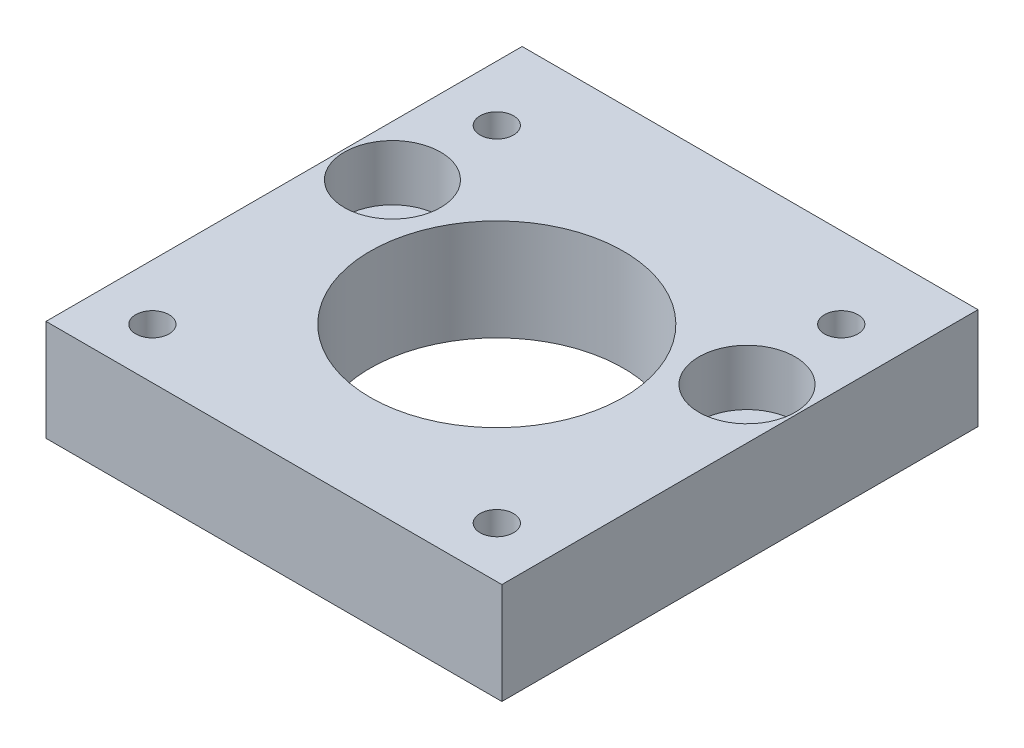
ISO-10303-21;
HEADER;
FILE_DESCRIPTION(('STEP AP214'),'2;1');
FILE_NAME('part.step','',(''),(''),'','','');
FILE_SCHEMA(('AUTOMOTIVE_DESIGN { 1 0 10303 214 1 1 1 1 }'));
ENDSEC;
DATA;
#1=APPLICATION_CONTEXT('core data for automotive mechanical design processes');
#2=APPLICATION_PROTOCOL_DEFINITION('international standard','automotive_design',2000,#1);
#3=PRODUCT_CONTEXT('',#1,'mechanical');
#4=PRODUCT('Part','Part','',(#3));
#5=PRODUCT_RELATED_PRODUCT_CATEGORY('part','',(#4));
#6=PRODUCT_DEFINITION_FORMATION('','',#4);
#7=PRODUCT_DEFINITION_CONTEXT('part definition',#1,'design');
#8=PRODUCT_DEFINITION('design','',#6,#7);
#9=PRODUCT_DEFINITION_SHAPE('','',#8);
#10=(LENGTH_UNIT() NAMED_UNIT(*) SI_UNIT(.MILLI.,.METRE.));
#11=(NAMED_UNIT(*) PLANE_ANGLE_UNIT() SI_UNIT($,.RADIAN.));
#12=(NAMED_UNIT(*) SI_UNIT($,.STERADIAN.) SOLID_ANGLE_UNIT());
#13=UNCERTAINTY_MEASURE_WITH_UNIT(LENGTH_MEASURE(1.E-05),#10,'distance_accuracy_value','');
#14=(GEOMETRIC_REPRESENTATION_CONTEXT(3) GLOBAL_UNCERTAINTY_ASSIGNED_CONTEXT((#13)) GLOBAL_UNIT_ASSIGNED_CONTEXT((#10,
#11,#12)) REPRESENTATION_CONTEXT('',''));
#15=CARTESIAN_POINT('',(0.,0.,0.));
#16=DIRECTION('',(0.,0.,1.));
#17=DIRECTION('',(1.,0.,0.));
#18=AXIS2_PLACEMENT_3D('',#15,#16,#17);
#19=CARTESIAN_POINT('',(5.,-36.9999999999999,17.7999999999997));
#20=DIRECTION('',(0.,1.,0.));
#21=DIRECTION('',(0.,0.,1.));
#22=AXIS2_PLACEMENT_3D('',#19,#20,#21);
#23=CYLINDRICAL_SURFACE('',#22,2.75);
#24=CARTESIAN_POINT('',(5.,1.11022302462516E-13,17.7999999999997));
#25=DIRECTION('',(0.,1.,0.));
#26=DIRECTION('',(0.,0.,1.));
#27=AXIS2_PLACEMENT_3D('',#24,#25,#26);
#28=CIRCLE('',#27,2.75);
#29=CARTESIAN_POINT('',(5.,1.11022302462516E-13,20.5499999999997));
#30=VERTEX_POINT('',#29);
#31=EDGE_CURVE('E109',#30,#30,#28,.T.);
#32=ORIENTED_EDGE('',*,*,#31,.F.);
#33=EDGE_LOOP('',(#32));
#34=FACE_BOUND('',#33,.T.);
#35=CARTESIAN_POINT('',(5.,4.50000000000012,17.7999999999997));
#36=DIRECTION('',(0.,1.,0.));
#37=DIRECTION('',(0.,0.,1.));
#38=AXIS2_PLACEMENT_3D('',#35,#36,#37);
#39=CIRCLE('',#38,2.75);
#40=CARTESIAN_POINT('',(5.,4.50000000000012,20.5499999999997));
#41=VERTEX_POINT('',#40);
#42=EDGE_CURVE('E36',#41,#41,#39,.F.);
#43=ORIENTED_EDGE('',*,*,#42,.F.);
#44=EDGE_LOOP('',(#43));
#45=FACE_BOUND('',#44,.T.);
#46=ADVANCED_FACE('F32',(#34,#45),#23,.F.);
#47=CARTESIAN_POINT('',(40.,-36.9999999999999,17.7999999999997));
#48=DIRECTION('',(0.,1.,0.));
#49=DIRECTION('',(0.,0.,1.));
#50=AXIS2_PLACEMENT_3D('',#47,#48,#49);
#51=CYLINDRICAL_SURFACE('',#50,2.75);
#52=CARTESIAN_POINT('',(40.,1.11022302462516E-13,17.7999999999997));
#53=DIRECTION('',(0.,1.,0.));
#54=DIRECTION('',(0.,0.,1.));
#55=AXIS2_PLACEMENT_3D('',#52,#53,#54);
#56=CIRCLE('',#55,2.75);
#57=CARTESIAN_POINT('',(40.,1.11022302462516E-13,20.5499999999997));
#58=VERTEX_POINT('',#57);
#59=EDGE_CURVE('E114',#58,#58,#56,.T.);
#60=ORIENTED_EDGE('',*,*,#59,.F.);
#61=EDGE_LOOP('',(#60));
#62=FACE_BOUND('',#61,.T.);
#63=CARTESIAN_POINT('',(40.,4.50000000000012,17.7999999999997));
#64=DIRECTION('',(0.,1.,0.));
#65=DIRECTION('',(0.,0.,1.));
#66=AXIS2_PLACEMENT_3D('',#63,#64,#65);
#67=CIRCLE('',#66,2.75);
#68=CARTESIAN_POINT('',(40.,4.50000000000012,20.5499999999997));
#69=VERTEX_POINT('',#68);
#70=EDGE_CURVE('E107',#69,#69,#67,.F.);
#71=ORIENTED_EDGE('',*,*,#70,.F.);
#72=EDGE_LOOP('',(#71));
#73=FACE_BOUND('',#72,.T.);
#74=ADVANCED_FACE('F177',(#62,#73),#51,.F.);
#75=CARTESIAN_POINT('',(0.,1.13686837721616E-13,47.));
#76=DIRECTION('',(1.,0.,0.));
#77=DIRECTION('',(0.,0.,-1.));
#78=AXIS2_PLACEMENT_3D('',#75,#76,#77);
#79=PLANE('',#78);
#80=DIRECTION('',(0.,-1.,0.));
#81=VECTOR('',#80,1.);
#82=CARTESIAN_POINT('',(0.,1.13686837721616E-13,0.));
#83=LINE('',#82,#81);
#84=CARTESIAN_POINT('',(0.,10.0000000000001,0.));
#85=VERTEX_POINT('',#84);
#86=CARTESIAN_POINT('',(0.,1.13686837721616E-13,0.));
#87=VERTEX_POINT('',#86);
#88=EDGE_CURVE('E99',#85,#87,#83,.T.);
#89=ORIENTED_EDGE('',*,*,#88,.T.);
#90=DIRECTION('',(0.,0.,-1.));
#91=VECTOR('',#90,1.);
#92=CARTESIAN_POINT('',(0.,1.13686837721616E-13,47.));
#93=LINE('',#92,#91);
#94=CARTESIAN_POINT('',(0.,1.13686837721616E-13,47.));
#95=VERTEX_POINT('',#94);
#96=EDGE_CURVE('E11',#95,#87,#93,.T.);
#97=ORIENTED_EDGE('',*,*,#96,.F.);
#98=DIRECTION('',(0.,-1.,0.));
#99=VECTOR('',#98,1.);
#100=CARTESIAN_POINT('',(0.,1.13686837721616E-13,47.));
#101=LINE('',#100,#99);
#102=CARTESIAN_POINT('',(0.,10.0000000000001,47.));
#103=VERTEX_POINT('',#102);
#104=EDGE_CURVE('E86',#103,#95,#101,.T.);
#105=ORIENTED_EDGE('',*,*,#104,.F.);
#106=DIRECTION('',(0.,0.,-1.));
#107=VECTOR('',#106,1.);
#108=CARTESIAN_POINT('',(0.,10.0000000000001,47.));
#109=LINE('',#108,#107);
#110=EDGE_CURVE('E95',#103,#85,#109,.T.);
#111=ORIENTED_EDGE('',*,*,#110,.T.);
#112=EDGE_LOOP('',(#89,#97,#105,#111));
#113=FACE_BOUND('',#112,.T.);
#114=ADVANCED_FACE('F34',(#113),#79,.F.);
#115=CARTESIAN_POINT('',(0.,1.13686837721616E-13,47.));
#116=DIRECTION('',(0.,1.,0.));
#117=DIRECTION('',(0.,0.,1.));
#118=AXIS2_PLACEMENT_3D('',#115,#116,#117);
#119=PLANE('',#118);
#120=ORIENTED_EDGE('',*,*,#31,.T.);
#121=EDGE_LOOP('',(#120));
#122=FACE_BOUND('',#121,.T.);
#123=ORIENTED_EDGE('',*,*,#59,.T.);
#124=EDGE_LOOP('',(#123));
#125=FACE_BOUND('',#124,.T.);
#126=CARTESIAN_POINT('',(5.5,1.11022302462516E-13,42.));
#127=DIRECTION('',(0.,1.,0.));
#128=DIRECTION('',(0.,0.,1.));
#129=AXIS2_PLACEMENT_3D('',#126,#127,#128);
#130=CIRCLE('',#129,1.65);
#131=CARTESIAN_POINT('',(5.5,1.11022302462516E-13,43.65));
#132=VERTEX_POINT('',#131);
#133=EDGE_CURVE('E132',#132,#132,#130,.T.);
#134=ORIENTED_EDGE('',*,*,#133,.T.);
#135=EDGE_LOOP('',(#134));
#136=FACE_BOUND('',#135,.T.);
#137=CARTESIAN_POINT('',(39.5,1.11022302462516E-13,42.));
#138=DIRECTION('',(0.,1.,0.));
#139=DIRECTION('',(0.,0.,1.));
#140=AXIS2_PLACEMENT_3D('',#137,#138,#139);
#141=CIRCLE('',#140,1.65);
#142=CARTESIAN_POINT('',(39.5,1.11022302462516E-13,43.65));
#143=VERTEX_POINT('',#142);
#144=EDGE_CURVE('E138',#143,#143,#141,.T.);
#145=ORIENTED_EDGE('',*,*,#144,.T.);
#146=EDGE_LOOP('',(#145));
#147=FACE_BOUND('',#146,.T.);
#148=CARTESIAN_POINT('',(39.5,1.11022302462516E-13,8.));
#149=DIRECTION('',(0.,1.,0.));
#150=DIRECTION('',(0.,0.,1.));
#151=AXIS2_PLACEMENT_3D('',#148,#149,#150);
#152=CIRCLE('',#151,1.65);
#153=CARTESIAN_POINT('',(39.5,1.11022302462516E-13,9.65));
#154=VERTEX_POINT('',#153);
#155=EDGE_CURVE('E144',#154,#154,#152,.T.);
#156=ORIENTED_EDGE('',*,*,#155,.T.);
#157=EDGE_LOOP('',(#156));
#158=FACE_BOUND('',#157,.T.);
#159=CARTESIAN_POINT('',(5.5,1.11022302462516E-13,8.));
#160=DIRECTION('',(0.,1.,0.));
#161=DIRECTION('',(0.,0.,1.));
#162=AXIS2_PLACEMENT_3D('',#159,#160,#161);
#163=CIRCLE('',#162,1.65);
#164=CARTESIAN_POINT('',(5.5,1.11022302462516E-13,9.65));
#165=VERTEX_POINT('',#164);
#166=EDGE_CURVE('E150',#165,#165,#163,.T.);
#167=ORIENTED_EDGE('',*,*,#166,.T.);
#168=EDGE_LOOP('',(#167));
#169=FACE_BOUND('',#168,.T.);
#170=CARTESIAN_POINT('',(22.5000000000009,1.11022302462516E-13,25.));
#171=DIRECTION('',(0.,1.,0.));
#172=DIRECTION('',(0.,0.,1.));
#173=AXIS2_PLACEMENT_3D('',#170,#171,#172);
#174=CIRCLE('',#173,12.5);
#175=CARTESIAN_POINT('',(22.5000000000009,1.11022302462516E-13,37.5));
#176=VERTEX_POINT('',#175);
#177=EDGE_CURVE('E102',#176,#176,#174,.T.);
#178=ORIENTED_EDGE('',*,*,#177,.T.);
#179=EDGE_LOOP('',(#178));
#180=FACE_BOUND('',#179,.T.);
#181=DIRECTION('',(1.,0.,0.));
#182=VECTOR('',#181,1.);
#183=CARTESIAN_POINT('',(0.,1.13686837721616E-13,0.));
#184=LINE('',#183,#182);
#185=CARTESIAN_POINT('',(45.,1.13686837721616E-13,0.));
#186=VERTEX_POINT('',#185);
#187=EDGE_CURVE('E90',#87,#186,#184,.T.);
#188=ORIENTED_EDGE('',*,*,#187,.T.);
#189=DIRECTION('',(0.,0.,-1.));
#190=VECTOR('',#189,1.);
#191=CARTESIAN_POINT('',(45.,1.13686837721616E-13,47.));
#192=LINE('',#191,#190);
#193=CARTESIAN_POINT('',(45.,1.13686837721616E-13,47.));
#194=VERTEX_POINT('',#193);
#195=EDGE_CURVE('E42',#194,#186,#192,.T.);
#196=ORIENTED_EDGE('',*,*,#195,.F.);
#197=DIRECTION('',(1.,0.,0.));
#198=VECTOR('',#197,1.);
#199=CARTESIAN_POINT('',(0.,1.13686837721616E-13,47.));
#200=LINE('',#199,#198);
#201=EDGE_CURVE('E81',#95,#194,#200,.T.);
#202=ORIENTED_EDGE('',*,*,#201,.F.);
#203=ORIENTED_EDGE('',*,*,#96,.T.);
#204=EDGE_LOOP('',(#188,#196,#202,#203));
#205=FACE_BOUND('',#204,.T.);
#206=ADVANCED_FACE('F89',(#122,#125,#136,#147,#158,#169,#180,#205),#119,.F.);
#207=CARTESIAN_POINT('',(45.,1.13686837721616E-13,47.));
#208=DIRECTION('',(-1.,0.,0.));
#209=DIRECTION('',(0.,0.,1.));
#210=AXIS2_PLACEMENT_3D('',#207,#208,#209);
#211=PLANE('',#210);
#212=DIRECTION('',(0.,1.,0.));
#213=VECTOR('',#212,1.);
#214=CARTESIAN_POINT('',(45.,1.13686837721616E-13,0.));
#215=LINE('',#214,#213);
#216=CARTESIAN_POINT('',(45.,10.0000000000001,0.));
#217=VERTEX_POINT('',#216);
#218=EDGE_CURVE('E68',#186,#217,#215,.T.);
#219=ORIENTED_EDGE('',*,*,#218,.T.);
#220=DIRECTION('',(0.,0.,-1.));
#221=VECTOR('',#220,1.);
#222=CARTESIAN_POINT('',(45.,10.0000000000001,47.));
#223=LINE('',#222,#221);
#224=CARTESIAN_POINT('',(45.,10.0000000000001,47.));
#225=VERTEX_POINT('',#224);
#226=EDGE_CURVE('E91',#225,#217,#223,.T.);
#227=ORIENTED_EDGE('',*,*,#226,.F.);
#228=DIRECTION('',(0.,1.,0.));
#229=VECTOR('',#228,1.);
#230=CARTESIAN_POINT('',(45.,1.13686837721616E-13,47.));
#231=LINE('',#230,#229);
#232=EDGE_CURVE('E84',#194,#225,#231,.T.);
#233=ORIENTED_EDGE('',*,*,#232,.F.);
#234=ORIENTED_EDGE('',*,*,#195,.T.);
#235=EDGE_LOOP('',(#219,#227,#233,#234));
#236=FACE_BOUND('',#235,.T.);
#237=ADVANCED_FACE('F93',(#236),#211,.F.);
#238=CARTESIAN_POINT('',(0.,10.0000000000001,47.));
#239=DIRECTION('',(0.,-1.,0.));
#240=DIRECTION('',(0.,0.,-1.));
#241=AXIS2_PLACEMENT_3D('',#238,#239,#240);
#242=PLANE('',#241);
#243=CARTESIAN_POINT('',(5.,10.0000000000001,17.7999999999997));
#244=DIRECTION('',(0.,1.,0.));
#245=DIRECTION('',(0.,0.,1.));
#246=AXIS2_PLACEMENT_3D('',#243,#244,#245);
#247=CIRCLE('',#246,4.75);
#248=CARTESIAN_POINT('',(5.,10.0000000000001,22.5499999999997));
#249=VERTEX_POINT('',#248);
#250=EDGE_CURVE('E124',#249,#249,#247,.T.);
#251=ORIENTED_EDGE('',*,*,#250,.F.);
#252=EDGE_LOOP('',(#251));
#253=FACE_BOUND('',#252,.T.);
#254=CARTESIAN_POINT('',(40.,10.0000000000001,17.7999999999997));
#255=DIRECTION('',(0.,1.,0.));
#256=DIRECTION('',(0.,0.,1.));
#257=AXIS2_PLACEMENT_3D('',#254,#255,#256);
#258=CIRCLE('',#257,4.75);
#259=CARTESIAN_POINT('',(40.,10.0000000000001,22.5499999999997));
#260=VERTEX_POINT('',#259);
#261=EDGE_CURVE('E117',#260,#260,#258,.T.);
#262=ORIENTED_EDGE('',*,*,#261,.F.);
#263=EDGE_LOOP('',(#262));
#264=FACE_BOUND('',#263,.T.);
#265=CARTESIAN_POINT('',(5.5,10.0000000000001,42.));
#266=DIRECTION('',(0.,1.,0.));
#267=DIRECTION('',(0.,0.,1.));
#268=AXIS2_PLACEMENT_3D('',#265,#266,#267);
#269=CIRCLE('',#268,1.65);
#270=CARTESIAN_POINT('',(5.5,10.0000000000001,43.65));
#271=VERTEX_POINT('',#270);
#272=EDGE_CURVE('E129',#271,#271,#269,.T.);
#273=ORIENTED_EDGE('',*,*,#272,.F.);
#274=EDGE_LOOP('',(#273));
#275=FACE_BOUND('',#274,.T.);
#276=CARTESIAN_POINT('',(39.5,10.0000000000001,42.));
#277=DIRECTION('',(0.,1.,0.));
#278=DIRECTION('',(0.,0.,1.));
#279=AXIS2_PLACEMENT_3D('',#276,#277,#278);
#280=CIRCLE('',#279,1.65);
#281=CARTESIAN_POINT('',(39.5,10.0000000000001,43.65));
#282=VERTEX_POINT('',#281);
#283=EDGE_CURVE('E135',#282,#282,#280,.T.);
#284=ORIENTED_EDGE('',*,*,#283,.F.);
#285=EDGE_LOOP('',(#284));
#286=FACE_BOUND('',#285,.T.);
#287=CARTESIAN_POINT('',(39.5,10.0000000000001,8.));
#288=DIRECTION('',(0.,1.,0.));
#289=DIRECTION('',(0.,0.,1.));
#290=AXIS2_PLACEMENT_3D('',#287,#288,#289);
#291=CIRCLE('',#290,1.65);
#292=CARTESIAN_POINT('',(39.5,10.0000000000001,9.65));
#293=VERTEX_POINT('',#292);
#294=EDGE_CURVE('E141',#293,#293,#291,.T.);
#295=ORIENTED_EDGE('',*,*,#294,.F.);
#296=EDGE_LOOP('',(#295));
#297=FACE_BOUND('',#296,.T.);
#298=CARTESIAN_POINT('',(5.5,10.0000000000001,8.));
#299=DIRECTION('',(0.,1.,0.));
#300=DIRECTION('',(0.,0.,1.));
#301=AXIS2_PLACEMENT_3D('',#298,#299,#300);
#302=CIRCLE('',#301,1.65);
#303=CARTESIAN_POINT('',(5.5,10.0000000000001,9.65));
#304=VERTEX_POINT('',#303);
#305=EDGE_CURVE('E147',#304,#304,#302,.T.);
#306=ORIENTED_EDGE('',*,*,#305,.F.);
#307=EDGE_LOOP('',(#306));
#308=FACE_BOUND('',#307,.T.);
#309=CARTESIAN_POINT('',(22.5000000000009,10.0000000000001,25.));
#310=DIRECTION('',(0.,1.,0.));
#311=DIRECTION('',(0.,0.,1.));
#312=AXIS2_PLACEMENT_3D('',#309,#310,#311);
#313=CIRCLE('',#312,12.5);
#314=CARTESIAN_POINT('',(22.5000000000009,10.0000000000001,37.5));
#315=VERTEX_POINT('',#314);
#316=EDGE_CURVE('E153',#315,#315,#313,.T.);
#317=ORIENTED_EDGE('',*,*,#316,.F.);
#318=EDGE_LOOP('',(#317));
#319=FACE_BOUND('',#318,.T.);
#320=DIRECTION('',(-1.,0.,0.));
#321=VECTOR('',#320,1.);
#322=CARTESIAN_POINT('',(0.,10.0000000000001,0.));
#323=LINE('',#322,#321);
#324=EDGE_CURVE('E74',#217,#85,#323,.T.);
#325=ORIENTED_EDGE('',*,*,#324,.T.);
#326=ORIENTED_EDGE('',*,*,#110,.F.);
#327=DIRECTION('',(-1.,0.,0.));
#328=VECTOR('',#327,1.);
#329=CARTESIAN_POINT('',(0.,10.0000000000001,47.));
#330=LINE('',#329,#328);
#331=EDGE_CURVE('E51',#225,#103,#330,.T.);
#332=ORIENTED_EDGE('',*,*,#331,.F.);
#333=ORIENTED_EDGE('',*,*,#226,.T.);
#334=EDGE_LOOP('',(#325,#326,#332,#333));
#335=FACE_BOUND('',#334,.T.);
#336=ADVANCED_FACE('F217',(#253,#264,#275,#286,#297,#308,#319,#335),#242,.F.);
#337=CARTESIAN_POINT('',(0.,10.0000000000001,47.));
#338=DIRECTION('',(0.,0.,-1.));
#339=DIRECTION('',(-1.,0.,0.));
#340=AXIS2_PLACEMENT_3D('',#337,#338,#339);
#341=PLANE('',#340);
#342=ORIENTED_EDGE('',*,*,#104,.T.);
#343=ORIENTED_EDGE('',*,*,#201,.T.);
#344=ORIENTED_EDGE('',*,*,#232,.T.);
#345=ORIENTED_EDGE('',*,*,#331,.T.);
#346=EDGE_LOOP('',(#342,#343,#344,#345));
#347=FACE_BOUND('',#346,.T.);
#348=ADVANCED_FACE('F82',(#347),#341,.F.);
#349=CARTESIAN_POINT('',(0.,10.0000000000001,0.));
#350=DIRECTION('',(0.,0.,-1.));
#351=DIRECTION('',(-1.,0.,0.));
#352=AXIS2_PLACEMENT_3D('',#349,#350,#351);
#353=PLANE('',#352);
#354=ORIENTED_EDGE('',*,*,#88,.F.);
#355=ORIENTED_EDGE('',*,*,#324,.F.);
#356=ORIENTED_EDGE('',*,*,#218,.F.);
#357=ORIENTED_EDGE('',*,*,#187,.F.);
#358=EDGE_LOOP('',(#354,#355,#356,#357));
#359=FACE_BOUND('',#358,.T.);
#360=ADVANCED_FACE('F163',(#359),#353,.T.);
#361=CARTESIAN_POINT('',(22.5000000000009,-36.9999999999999,25.));
#362=DIRECTION('',(0.,1.,0.));
#363=DIRECTION('',(0.,0.,1.));
#364=AXIS2_PLACEMENT_3D('',#361,#362,#363);
#365=CYLINDRICAL_SURFACE('',#364,12.5);
#366=ORIENTED_EDGE('',*,*,#316,.T.);
#367=EDGE_LOOP('',(#366));
#368=FACE_BOUND('',#367,.T.);
#369=ORIENTED_EDGE('',*,*,#177,.F.);
#370=EDGE_LOOP('',(#369));
#371=FACE_BOUND('',#370,.T.);
#372=ADVANCED_FACE('F160',(#368,#371),#365,.F.);
#373=CARTESIAN_POINT('',(5.5,-36.9999999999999,8.));
#374=DIRECTION('',(0.,1.,0.));
#375=DIRECTION('',(0.,0.,1.));
#376=AXIS2_PLACEMENT_3D('',#373,#374,#375);
#377=CYLINDRICAL_SURFACE('',#376,1.65);
#378=ORIENTED_EDGE('',*,*,#305,.T.);
#379=EDGE_LOOP('',(#378));
#380=FACE_BOUND('',#379,.T.);
#381=ORIENTED_EDGE('',*,*,#166,.F.);
#382=EDGE_LOOP('',(#381));
#383=FACE_BOUND('',#382,.T.);
#384=ADVANCED_FACE('F162',(#380,#383),#377,.F.);
#385=CARTESIAN_POINT('',(39.5,-36.9999999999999,8.));
#386=DIRECTION('',(0.,1.,0.));
#387=DIRECTION('',(0.,0.,1.));
#388=AXIS2_PLACEMENT_3D('',#385,#386,#387);
#389=CYLINDRICAL_SURFACE('',#388,1.65);
#390=ORIENTED_EDGE('',*,*,#294,.T.);
#391=EDGE_LOOP('',(#390));
#392=FACE_BOUND('',#391,.T.);
#393=ORIENTED_EDGE('',*,*,#155,.F.);
#394=EDGE_LOOP('',(#393));
#395=FACE_BOUND('',#394,.T.);
#396=ADVANCED_FACE('F170',(#392,#395),#389,.F.);
#397=CARTESIAN_POINT('',(39.5,-36.9999999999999,42.));
#398=DIRECTION('',(0.,1.,0.));
#399=DIRECTION('',(0.,0.,1.));
#400=AXIS2_PLACEMENT_3D('',#397,#398,#399);
#401=CYLINDRICAL_SURFACE('',#400,1.65);
#402=ORIENTED_EDGE('',*,*,#283,.T.);
#403=EDGE_LOOP('',(#402));
#404=FACE_BOUND('',#403,.T.);
#405=ORIENTED_EDGE('',*,*,#144,.F.);
#406=EDGE_LOOP('',(#405));
#407=FACE_BOUND('',#406,.T.);
#408=ADVANCED_FACE('F195',(#404,#407),#401,.F.);
#409=CARTESIAN_POINT('',(5.5,-36.9999999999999,42.));
#410=DIRECTION('',(0.,1.,0.));
#411=DIRECTION('',(0.,0.,1.));
#412=AXIS2_PLACEMENT_3D('',#409,#410,#411);
#413=CYLINDRICAL_SURFACE('',#412,1.65);
#414=ORIENTED_EDGE('',*,*,#272,.T.);
#415=EDGE_LOOP('',(#414));
#416=FACE_BOUND('',#415,.T.);
#417=ORIENTED_EDGE('',*,*,#133,.F.);
#418=EDGE_LOOP('',(#417));
#419=FACE_BOUND('',#418,.T.);
#420=ADVANCED_FACE('F191',(#416,#419),#413,.F.);
#421=CARTESIAN_POINT('',(40.,4.50000000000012,17.7999999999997));
#422=DIRECTION('',(0.,1.,0.));
#423=DIRECTION('',(0.,0.,1.));
#424=AXIS2_PLACEMENT_3D('',#421,#422,#423);
#425=PLANE('',#424);
#426=CARTESIAN_POINT('',(40.,4.50000000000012,17.7999999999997));
#427=DIRECTION('',(0.,1.,0.));
#428=DIRECTION('',(0.,0.,1.));
#429=AXIS2_PLACEMENT_3D('',#426,#427,#428);
#430=CIRCLE('',#429,4.75);
#431=CARTESIAN_POINT('',(40.,4.50000000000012,22.5499999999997));
#432=VERTEX_POINT('',#431);
#433=EDGE_CURVE('E110',#432,#432,#430,.T.);
#434=ORIENTED_EDGE('',*,*,#433,.T.);
#435=EDGE_LOOP('',(#434));
#436=FACE_BOUND('',#435,.T.);
#437=ORIENTED_EDGE('',*,*,#70,.T.);
#438=EDGE_LOOP('',(#437));
#439=FACE_BOUND('',#438,.T.);
#440=ADVANCED_FACE('F194',(#436,#439),#425,.T.);
#441=CARTESIAN_POINT('',(40.,4.50000000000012,17.7999999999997));
#442=DIRECTION('',(0.,1.,0.));
#443=DIRECTION('',(0.,0.,1.));
#444=AXIS2_PLACEMENT_3D('',#441,#442,#443);
#445=CYLINDRICAL_SURFACE('',#444,4.75);
#446=ORIENTED_EDGE('',*,*,#433,.F.);
#447=EDGE_LOOP('',(#446));
#448=FACE_BOUND('',#447,.T.);
#449=ORIENTED_EDGE('',*,*,#261,.T.);
#450=EDGE_LOOP('',(#449));
#451=FACE_BOUND('',#450,.T.);
#452=ADVANCED_FACE('F188',(#448,#451),#445,.F.);
#453=CARTESIAN_POINT('',(5.,4.50000000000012,17.7999999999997));
#454=DIRECTION('',(0.,1.,0.));
#455=DIRECTION('',(0.,0.,1.));
#456=AXIS2_PLACEMENT_3D('',#453,#454,#455);
#457=PLANE('',#456);
#458=CARTESIAN_POINT('',(5.,4.50000000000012,17.7999999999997));
#459=DIRECTION('',(0.,1.,0.));
#460=DIRECTION('',(0.,0.,1.));
#461=AXIS2_PLACEMENT_3D('',#458,#459,#460);
#462=CIRCLE('',#461,4.75);
#463=CARTESIAN_POINT('',(5.,4.50000000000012,22.5499999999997));
#464=VERTEX_POINT('',#463);
#465=EDGE_CURVE('E322',#464,#464,#462,.T.);
#466=ORIENTED_EDGE('',*,*,#465,.T.);
#467=EDGE_LOOP('',(#466));
#468=FACE_BOUND('',#467,.T.);
#469=ORIENTED_EDGE('',*,*,#42,.T.);
#470=EDGE_LOOP('',(#469));
#471=FACE_BOUND('',#470,.T.);
#472=ADVANCED_FACE('F296',(#468,#471),#457,.T.);
#473=CARTESIAN_POINT('',(5.,4.50000000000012,17.7999999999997));
#474=DIRECTION('',(0.,1.,0.));
#475=DIRECTION('',(0.,0.,1.));
#476=AXIS2_PLACEMENT_3D('',#473,#474,#475);
#477=CYLINDRICAL_SURFACE('',#476,4.75);
#478=ORIENTED_EDGE('',*,*,#465,.F.);
#479=EDGE_LOOP('',(#478));
#480=FACE_BOUND('',#479,.T.);
#481=ORIENTED_EDGE('',*,*,#250,.T.);
#482=EDGE_LOOP('',(#481));
#483=FACE_BOUND('',#482,.T.);
#484=ADVANCED_FACE('F305',(#480,#483),#477,.F.);
#485=CLOSED_SHELL('',(#46,#74,#114,#206,#237,#336,#348,#360,#372,#384,#396,#408,#420,#440,#452,
#472,#484));
#486=MANIFOLD_SOLID_BREP('B2',#485);
#487=ADVANCED_BREP_SHAPE_REPRESENTATION('',(#18,#486),#14);
#488=SHAPE_DEFINITION_REPRESENTATION(#9,#487);
ENDSEC;
END-ISO-10303-21;
